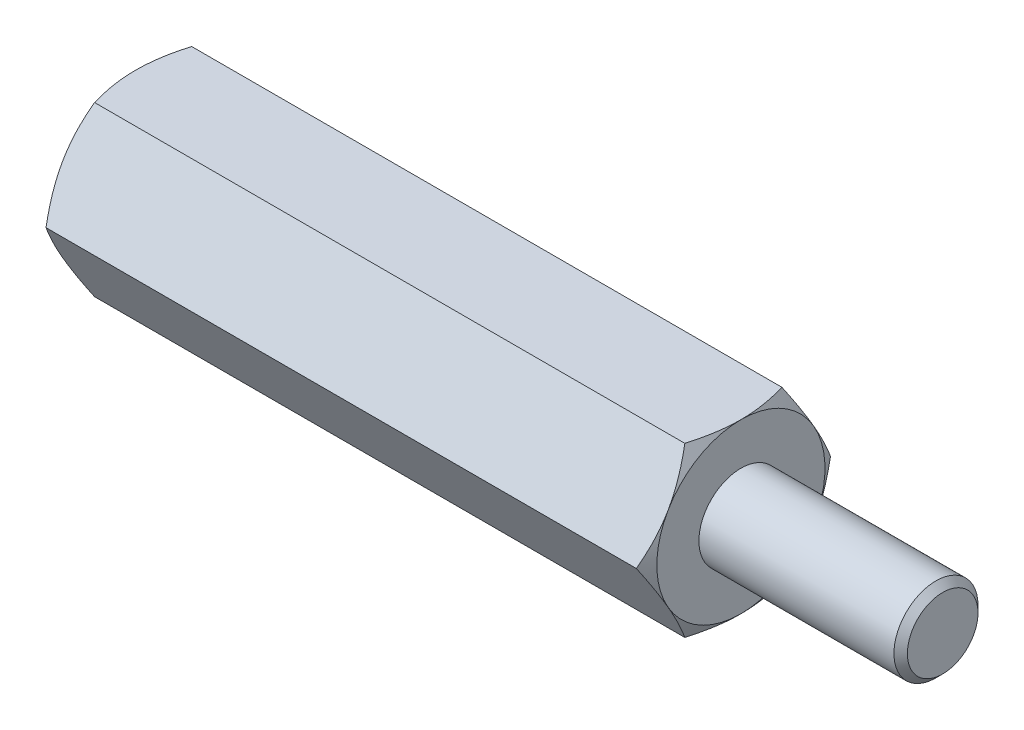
ISO-10303-21;
HEADER;
FILE_DESCRIPTION(('STEP AP214'),'2;1');
FILE_NAME('part.step','',(''),(''),'','','');
FILE_SCHEMA(('AUTOMOTIVE_DESIGN { 1 0 10303 214 1 1 1 1 }'));
ENDSEC;
DATA;
#1=APPLICATION_CONTEXT('core data for automotive mechanical design processes');
#2=APPLICATION_PROTOCOL_DEFINITION('international standard','automotive_design',2000,#1);
#3=PRODUCT_CONTEXT('',#1,'mechanical');
#4=PRODUCT('Part','Part','',(#3));
#5=PRODUCT_RELATED_PRODUCT_CATEGORY('part','',(#4));
#6=PRODUCT_DEFINITION_FORMATION('','',#4);
#7=PRODUCT_DEFINITION_CONTEXT('part definition',#1,'design');
#8=PRODUCT_DEFINITION('design','',#6,#7);
#9=PRODUCT_DEFINITION_SHAPE('','',#8);
#10=(LENGTH_UNIT() NAMED_UNIT(*) SI_UNIT(.MILLI.,.METRE.));
#11=(NAMED_UNIT(*) PLANE_ANGLE_UNIT() SI_UNIT($,.RADIAN.));
#12=(NAMED_UNIT(*) SI_UNIT($,.STERADIAN.) SOLID_ANGLE_UNIT());
#13=UNCERTAINTY_MEASURE_WITH_UNIT(LENGTH_MEASURE(1.E-05),#10,'distance_accuracy_value','');
#14=(GEOMETRIC_REPRESENTATION_CONTEXT(3) GLOBAL_UNCERTAINTY_ASSIGNED_CONTEXT((#13)) GLOBAL_UNIT_ASSIGNED_CONTEXT((#10,
#11,#12)) REPRESENTATION_CONTEXT('',''));
#15=CARTESIAN_POINT('',(0.,0.,0.));
#16=DIRECTION('',(0.,0.,1.));
#17=DIRECTION('',(1.,0.,0.));
#18=AXIS2_PLACEMENT_3D('',#15,#16,#17);
#19=CARTESIAN_POINT('',(9.,2.5,-1.44337567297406));
#20=DIRECTION('',(1.,0.,0.));
#21=DIRECTION('',(0.,0.,-1.));
#22=AXIS2_PLACEMENT_3D('',#19,#20,#21);
#23=PLANE('',#22);
#24=CARTESIAN_POINT('',(9.,0.,0.));
#25=DIRECTION('',(1.,0.,0.));
#26=DIRECTION('',(0.,0.,-1.));
#27=AXIS2_PLACEMENT_3D('',#24,#25,#26);
#28=CIRCLE('',#27,2.5);
#29=CARTESIAN_POINT('',(9.,-1.25,-2.1650635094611));
#30=VERTEX_POINT('',#29);
#31=CARTESIAN_POINT('',(9.,1.25,-2.1650635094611));
#32=VERTEX_POINT('',#31);
#33=EDGE_CURVE('E288',#30,#32,#28,.T.);
#34=ORIENTED_EDGE('',*,*,#33,.T.);
#35=CARTESIAN_POINT('',(9.,2.5,0.));
#36=VERTEX_POINT('',#35);
#37=EDGE_CURVE('E53',#32,#36,#28,.T.);
#38=ORIENTED_EDGE('',*,*,#37,.T.);
#39=CARTESIAN_POINT('',(9.,1.25,2.1650635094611));
#40=VERTEX_POINT('',#39);
#41=EDGE_CURVE('E295',#36,#40,#28,.T.);
#42=ORIENTED_EDGE('',*,*,#41,.T.);
#43=CARTESIAN_POINT('',(9.,-1.25,2.1650635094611));
#44=VERTEX_POINT('',#43);
#45=EDGE_CURVE('E301',#40,#44,#28,.T.);
#46=ORIENTED_EDGE('',*,*,#45,.T.);
#47=CARTESIAN_POINT('',(9.,0.,0.));
#48=DIRECTION('',(-1.,0.,0.));
#49=DIRECTION('',(0.,-1.,0.));
#50=AXIS2_PLACEMENT_3D('',#47,#48,#49);
#51=CIRCLE('',#50,2.5);
#52=CARTESIAN_POINT('',(9.,-2.5,0.));
#53=VERTEX_POINT('',#52);
#54=EDGE_CURVE('E193',#53,#44,#51,.T.);
#55=ORIENTED_EDGE('',*,*,#54,.F.);
#56=EDGE_CURVE('E61',#53,#30,#28,.T.);
#57=ORIENTED_EDGE('',*,*,#56,.T.);
#58=EDGE_LOOP('',(#34,#38,#42,#46,#55,#57));
#59=FACE_BOUND('',#58,.T.);
#60=CARTESIAN_POINT('',(9.,0.,0.));
#61=DIRECTION('',(1.,0.,0.));
#62=DIRECTION('',(0.,0.,-1.));
#63=AXIS2_PLACEMENT_3D('',#60,#61,#62);
#64=CIRCLE('',#63,1.25);
#65=CARTESIAN_POINT('',(9.,0.,-1.25));
#66=VERTEX_POINT('',#65);
#67=EDGE_CURVE('E351',#66,#66,#64,.T.);
#68=ORIENTED_EDGE('',*,*,#67,.F.);
#69=EDGE_LOOP('',(#68));
#70=FACE_BOUND('',#69,.T.);
#71=ADVANCED_FACE('F37',(#59,#70),#23,.T.);
#72=CARTESIAN_POINT('',(9.,0.,-2.88675134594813));
#73=DIRECTION('',(0.,-0.5,0.866025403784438));
#74=DIRECTION('',(0.,-0.866025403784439,-0.5));
#75=AXIS2_PLACEMENT_3D('',#72,#73,#74);
#76=PLANE('',#75);
#77=CARTESIAN_POINT('',(8.7766423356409,-0.000199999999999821,-2.88686681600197));
#78=CARTESIAN_POINT('',(8.81327837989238,0.109663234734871,-2.82343724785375));
#79=CARTESIAN_POINT('',(8.84659778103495,0.220474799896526,-2.75946016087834));
#80=CARTESIAN_POINT('',(8.90475771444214,0.44401683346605,-2.63039810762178));
#81=CARTESIAN_POINT('',(8.92957767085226,0.556751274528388,-2.5653108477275));
#82=CARTESIAN_POINT('',(8.96821434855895,0.780822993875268,-2.43594298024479));
#83=CARTESIAN_POINT('',(8.98228820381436,0.892125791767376,-2.37168227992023));
#84=CARTESIAN_POINT('',(8.99909084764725,1.11525522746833,-2.24285844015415));
#85=CARTESIAN_POINT('',(9.00183354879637,1.22708105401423,-2.17829576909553));
#86=CARTESIAN_POINT('',(8.99613423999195,1.43604197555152,-2.05765212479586));
#87=CARTESIAN_POINT('',(8.98909160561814,1.53320831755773,-2.0015531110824));
#88=CARTESIAN_POINT('',(8.96676858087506,1.726907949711,-1.88972057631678));
#89=CARTESIAN_POINT('',(8.95148056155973,1.82344056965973,-1.8339874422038));
#90=CARTESIAN_POINT('',(8.91326090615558,2.01753972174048,-1.7219242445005));
#91=CARTESIAN_POINT('',(8.89016722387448,2.11508168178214,-1.66560836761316));
#92=CARTESIAN_POINT('',(8.83775334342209,2.30871060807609,-1.55381665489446));
#93=CARTESIAN_POINT('',(8.80844546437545,2.40480005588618,-1.49833938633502));
#94=CARTESIAN_POINT('',(8.7766423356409,2.5002,-1.44326020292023));
#95=B_SPLINE_CURVE_WITH_KNOTS('',3,(#77,#78,#79,#80,#81,#82,#83,#84,#85,#86,#87,#88,#89,#90,#91,
#92,#93,#94),.UNSPECIFIED.,.F.,.F.,(4,2,2,2,2,2,2,2,4),(0.,0.396285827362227,0.79352433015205,
1.18093086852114,1.56786160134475,1.90479741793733,2.24204551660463,2.58677531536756,
2.93082800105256),.UNSPECIFIED.);
#96=CARTESIAN_POINT('',(8.7767090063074,0.,-2.88675134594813));
#97=VERTEX_POINT('',#96);
#98=EDGE_CURVE('E324',#97,#32,#95,.T.);
#99=ORIENTED_EDGE('',*,*,#98,.F.);
#100=DIRECTION('',(-1.,0.,0.));
#101=VECTOR('',#100,1.);
#102=CARTESIAN_POINT('',(9.,0.,-2.88675134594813));
#103=LINE('',#102,#101);
#104=CARTESIAN_POINT('',(-8.7767090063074,0.,-2.88675134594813));
#105=VERTEX_POINT('',#104);
#106=EDGE_CURVE('E264',#97,#105,#103,.T.);
#107=ORIENTED_EDGE('',*,*,#106,.T.);
#108=CARTESIAN_POINT('',(-8.7766423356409,2.5002,-1.44326020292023));
#109=CARTESIAN_POINT('',(-8.81327837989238,2.39033676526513,-1.50668977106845));
#110=CARTESIAN_POINT('',(-8.84659778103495,2.27952520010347,-1.57066685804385));
#111=CARTESIAN_POINT('',(-8.90475771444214,2.05598316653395,-1.69972891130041));
#112=CARTESIAN_POINT('',(-8.92957767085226,1.94324872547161,-1.7648161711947));
#113=CARTESIAN_POINT('',(-8.96821434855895,1.71917700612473,-1.8941840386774));
#114=CARTESIAN_POINT('',(-8.98228820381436,1.60787420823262,-1.95844473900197));
#115=CARTESIAN_POINT('',(-8.99909084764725,1.38474477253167,-2.08726857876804));
#116=CARTESIAN_POINT('',(-9.00183354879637,1.27291894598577,-2.15183124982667));
#117=CARTESIAN_POINT('',(-8.99613423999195,1.06395802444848,-2.27247489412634));
#118=CARTESIAN_POINT('',(-8.98909160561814,0.96679168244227,-2.32857390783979));
#119=CARTESIAN_POINT('',(-8.96676858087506,0.773092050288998,-2.44040644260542));
#120=CARTESIAN_POINT('',(-8.95148056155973,0.676559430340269,-2.49613957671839));
#121=CARTESIAN_POINT('',(-8.91326090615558,0.482460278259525,-2.60820277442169));
#122=CARTESIAN_POINT('',(-8.89016722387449,0.38491831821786,-2.66451865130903));
#123=CARTESIAN_POINT('',(-8.83775334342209,0.191289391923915,-2.77631036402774));
#124=CARTESIAN_POINT('',(-8.80844546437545,0.0951999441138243,-2.83178763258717));
#125=CARTESIAN_POINT('',(-8.7766423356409,-0.000199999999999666,-2.88686681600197));
#126=B_SPLINE_CURVE_WITH_KNOTS('',3,(#108,#109,#110,#111,#112,#113,#114,#115,#116,#117,#118,
#119,#120,#121,#122,#123,#124,#125),.UNSPECIFIED.,.F.,.F.,(4,2,2,2,2,2,2,2,4),(0.,
0.396285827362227,0.79352433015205,1.18093086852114,1.56786160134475,1.90479741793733,
2.24204551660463,2.58677531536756,2.93082800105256),.UNSPECIFIED.);
#127=CARTESIAN_POINT('',(-9.,1.25,-2.1650635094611));
#128=VERTEX_POINT('',#127);
#129=EDGE_CURVE('E318',#128,#105,#126,.T.);
#130=ORIENTED_EDGE('',*,*,#129,.F.);
#131=CARTESIAN_POINT('',(-8.7767090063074,2.5,-1.44337567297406));
#132=VERTEX_POINT('',#131);
#133=EDGE_CURVE('E321',#132,#128,#126,.T.);
#134=ORIENTED_EDGE('',*,*,#133,.F.);
#135=DIRECTION('',(-1.,0.,0.));
#136=VECTOR('',#135,1.);
#137=CARTESIAN_POINT('',(9.,2.5,-1.44337567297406));
#138=LINE('',#137,#136);
#139=CARTESIAN_POINT('',(8.77670900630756,2.5,-1.44337567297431));
#140=VERTEX_POINT('',#139);
#141=EDGE_CURVE('E279',#140,#132,#138,.T.);
#142=ORIENTED_EDGE('',*,*,#141,.F.);
#143=EDGE_CURVE('E229',#32,#140,#95,.T.);
#144=ORIENTED_EDGE('',*,*,#143,.F.);
#145=EDGE_LOOP('',(#99,#107,#130,#134,#142,#144));
#146=FACE_BOUND('',#145,.T.);
#147=ADVANCED_FACE('F148',(#146),#76,.F.);
#148=CARTESIAN_POINT('',(9.,2.5,-1.44337567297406));
#149=DIRECTION('',(0.,-1.,0.));
#150=DIRECTION('',(0.,0.,-1.));
#151=AXIS2_PLACEMENT_3D('',#148,#149,#150);
#152=PLANE('',#151);
#153=CARTESIAN_POINT('',(7.76803388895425,2.5,-3.90158441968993));
#154=CARTESIAN_POINT('',(7.82120772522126,2.5,-3.79217004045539));
#155=CARTESIAN_POINT('',(7.87387869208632,2.5,-3.68250707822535));
#156=CARTESIAN_POINT('',(7.97793249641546,2.5,-3.46255185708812));
#157=CARTESIAN_POINT('',(8.02931513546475,2.5,-3.35225950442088));
#158=CARTESIAN_POINT('',(8.13076309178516,2.5,-3.13035696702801));
#159=CARTESIAN_POINT('',(8.18081992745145,2.5,-3.0187428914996));
#160=CARTESIAN_POINT('',(8.27891712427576,2.5,-2.79463535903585));
#161=CARTESIAN_POINT('',(8.32695757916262,2.5,-2.68214194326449));
#162=CARTESIAN_POINT('',(8.42201845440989,2.5,-2.45240385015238));
#163=CARTESIAN_POINT('',(8.46895431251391,2.5,-2.33512399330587));
#164=CARTESIAN_POINT('',(8.55933269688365,2.5,-2.09920133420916));
#165=CARTESIAN_POINT('',(8.60277483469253,2.5,-1.98055838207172));
#166=CARTESIAN_POINT('',(8.68504351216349,2.5,-1.74193489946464));
#167=CARTESIAN_POINT('',(8.72387917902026,2.5,-1.6219575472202));
#168=CARTESIAN_POINT('',(8.79570507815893,2.5,-1.38028205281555));
#169=CARTESIAN_POINT('',(8.82869712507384,2.5,-1.25858445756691));
#170=CARTESIAN_POINT('',(8.88709594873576,2.5,-1.01406369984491));
#171=CARTESIAN_POINT('',(8.91254379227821,2.5,-0.89125052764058));
#172=CARTESIAN_POINT('',(8.95442751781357,2.5,-0.644071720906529));
#173=CARTESIAN_POINT('',(8.97086432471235,2.5,-0.519706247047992));
#174=CARTESIAN_POINT('',(8.9932006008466,2.5,-0.271679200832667));
#175=CARTESIAN_POINT('',(8.99923751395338,2.5,-0.148030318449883));
#176=CARTESIAN_POINT('',(9.00062561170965,2.5,0.0993395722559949));
#177=CARTESIAN_POINT('',(8.99597656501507,2.5,0.223060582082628));
#178=CARTESIAN_POINT('',(8.97940443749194,2.5,0.432351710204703));
#179=CARTESIAN_POINT('',(8.97010665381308,2.5,0.518143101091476));
#180=CARTESIAN_POINT('',(8.94693847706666,2.5,0.689112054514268));
#181=CARTESIAN_POINT('',(8.93306748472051,2.5,0.77428953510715));
#182=CARTESIAN_POINT('',(8.88532020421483,2.5,1.02876599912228));
#183=CARTESIAN_POINT('',(8.84531764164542,2.5,1.19691958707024));
#184=CARTESIAN_POINT('',(8.75226567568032,2.5,1.53362893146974));
#185=CARTESIAN_POINT('',(8.69893620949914,2.5,1.70210423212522));
#186=CARTESIAN_POINT('',(8.61237169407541,2.5,1.95247339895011));
#187=CARTESIAN_POINT('',(8.58242477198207,2.5,2.03553184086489));
#188=CARTESIAN_POINT('',(8.52068409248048,2.5,2.20095860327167));
#189=CARTESIAN_POINT('',(8.48889037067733,2.5,2.2833269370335));
#190=CARTESIAN_POINT('',(8.40401426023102,2.5,2.49723312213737));
#191=CARTESIAN_POINT('',(8.34971733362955,2.5,2.6282879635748));
#192=CARTESIAN_POINT('',(8.23812739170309,2.5,2.88912034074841));
#193=CARTESIAN_POINT('',(8.1808341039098,2.5,3.01889775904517));
#194=CARTESIAN_POINT('',(8.06393487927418,2.5,3.27745045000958));
#195=CARTESIAN_POINT('',(8.00432825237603,2.5,3.40622540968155));
#196=CARTESIAN_POINT('',(7.88332345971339,2.5,3.66293235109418));
#197=CARTESIAN_POINT('',(7.82192524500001,2.5,3.79086430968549));
#198=CARTESIAN_POINT('',(7.6354580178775,2.5,4.17399495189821));
#199=CARTESIAN_POINT('',(7.50828249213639,2.5,4.42816724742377));
#200=CARTESIAN_POINT('',(7.25034557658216,2.5,4.93461464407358));
#201=CARTESIAN_POINT('',(7.11958483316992,2.5,5.18689007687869));
#202=CARTESIAN_POINT('',(6.86871001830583,2.5,5.66512451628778));
#203=CARTESIAN_POINT('',(6.74882986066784,2.5,5.89120644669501));
#204=CARTESIAN_POINT('',(6.50759021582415,2.5,6.34259369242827));
#205=CARTESIAN_POINT('',(6.38623065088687,2.5,6.56789896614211));
#206=CARTESIAN_POINT('',(6.14278038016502,2.5,7.01722044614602));
#207=CARTESIAN_POINT('',(6.02069305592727,2.5,7.24123848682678));
#208=CARTESIAN_POINT('',(5.77566624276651,2.5,7.68878772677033));
#209=CARTESIAN_POINT('',(5.65272681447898,2.5,7.91231895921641));
#210=CARTESIAN_POINT('',(5.52947566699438,2.5,8.13567697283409));
#211=B_SPLINE_CURVE_WITH_KNOTS('',3,(#153,#154,#155,#156,#157,#158,#159,#160,#161,#162,#163,
#164,#165,#166,#167,#168,#169,#170,#171,#172,#173,#174,#175,#176,#177,#178,#179,#180,#181,#182,
#183,#184,#185,#186,#187,#188,#189,#190,#191,#192,#193,#194,#195,#196,#197,#198,#199,#200,#201,
#202,#203,#204,#205,#206,#207,#208,#209,#210),.UNSPECIFIED.,.F.,.F.,(4,2,2,2,2,2,2,2,2,2,2,2,2,
2,2,2,2,2,2,2,2,2,2,2,2,2,2,2,4),(0.,0.364957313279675,0.729970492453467,1.09692930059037,
1.46387103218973,1.84279746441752,2.22176597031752,2.59997058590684,2.97805755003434,
3.35404692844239,3.72999770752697,4.10094071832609,4.47189175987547,4.73064905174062,
4.98944026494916,5.5072907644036,6.03710483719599,6.30196454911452,6.56681915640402,
6.99233818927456,7.41789598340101,7.84358170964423,8.26927907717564,9.12186602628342,
9.9743002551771,10.7419897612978,11.5097197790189,12.2750964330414,13.0404191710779),.UNSPECIFIED.);
#212=EDGE_CURVE('E227',#140,#36,#211,.T.);
#213=ORIENTED_EDGE('',*,*,#212,.F.);
#214=ORIENTED_EDGE('',*,*,#141,.T.);
#215=CARTESIAN_POINT('',(-7.76803388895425,2.5,-3.90158441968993));
#216=CARTESIAN_POINT('',(-7.82120772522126,2.5,-3.79217004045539));
#217=CARTESIAN_POINT('',(-7.87387869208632,2.5,-3.68250707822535));
#218=CARTESIAN_POINT('',(-7.97793249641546,2.5,-3.46255185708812));
#219=CARTESIAN_POINT('',(-8.02931513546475,2.5,-3.35225950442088));
#220=CARTESIAN_POINT('',(-8.13076309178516,2.5,-3.13035696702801));
#221=CARTESIAN_POINT('',(-8.18081992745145,2.5,-3.0187428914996));
#222=CARTESIAN_POINT('',(-8.27891712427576,2.5,-2.79463535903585));
#223=CARTESIAN_POINT('',(-8.32695757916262,2.5,-2.68214194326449));
#224=CARTESIAN_POINT('',(-8.42201845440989,2.5,-2.45240385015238));
#225=CARTESIAN_POINT('',(-8.46895431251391,2.5,-2.33512399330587));
#226=CARTESIAN_POINT('',(-8.55933269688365,2.5,-2.09920133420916));
#227=CARTESIAN_POINT('',(-8.60277483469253,2.5,-1.98055838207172));
#228=CARTESIAN_POINT('',(-8.68504351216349,2.5,-1.74193489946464));
#229=CARTESIAN_POINT('',(-8.72387917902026,2.5,-1.6219575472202));
#230=CARTESIAN_POINT('',(-8.79570507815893,2.5,-1.38028205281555));
#231=CARTESIAN_POINT('',(-8.82869712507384,2.5,-1.25858445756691));
#232=CARTESIAN_POINT('',(-8.88709594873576,2.5,-1.01406369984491));
#233=CARTESIAN_POINT('',(-8.91254379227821,2.5,-0.89125052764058));
#234=CARTESIAN_POINT('',(-8.95442751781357,2.5,-0.644071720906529));
#235=CARTESIAN_POINT('',(-8.97086432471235,2.5,-0.519706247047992));
#236=CARTESIAN_POINT('',(-8.9932006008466,2.5,-0.271679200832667));
#237=CARTESIAN_POINT('',(-8.99923751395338,2.5,-0.148030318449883));
#238=CARTESIAN_POINT('',(-9.00062561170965,2.5,0.0993395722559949));
#239=CARTESIAN_POINT('',(-8.99597656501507,2.5,0.223060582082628));
#240=CARTESIAN_POINT('',(-8.97940443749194,2.5,0.432351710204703));
#241=CARTESIAN_POINT('',(-8.97010665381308,2.5,0.518143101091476));
#242=CARTESIAN_POINT('',(-8.94693847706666,2.5,0.689112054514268));
#243=CARTESIAN_POINT('',(-8.93306748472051,2.5,0.77428953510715));
#244=CARTESIAN_POINT('',(-8.88532020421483,2.5,1.02876599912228));
#245=CARTESIAN_POINT('',(-8.84531764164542,2.5,1.19691958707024));
#246=CARTESIAN_POINT('',(-8.75226567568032,2.5,1.53362893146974));
#247=CARTESIAN_POINT('',(-8.69893620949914,2.5,1.70210423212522));
#248=CARTESIAN_POINT('',(-8.61237169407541,2.5,1.95247339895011));
#249=CARTESIAN_POINT('',(-8.58242477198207,2.5,2.03553184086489));
#250=CARTESIAN_POINT('',(-8.52068409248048,2.5,2.20095860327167));
#251=CARTESIAN_POINT('',(-8.48889037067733,2.5,2.2833269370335));
#252=CARTESIAN_POINT('',(-8.40401426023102,2.5,2.49723312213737));
#253=CARTESIAN_POINT('',(-8.34971733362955,2.5,2.6282879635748));
#254=CARTESIAN_POINT('',(-8.23812739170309,2.5,2.88912034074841));
#255=CARTESIAN_POINT('',(-8.1808341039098,2.5,3.01889775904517));
#256=CARTESIAN_POINT('',(-8.06393487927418,2.5,3.27745045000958));
#257=CARTESIAN_POINT('',(-8.00432825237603,2.5,3.40622540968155));
#258=CARTESIAN_POINT('',(-7.88332345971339,2.5,3.66293235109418));
#259=CARTESIAN_POINT('',(-7.82192524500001,2.5,3.79086430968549));
#260=CARTESIAN_POINT('',(-7.6354580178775,2.5,4.17399495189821));
#261=CARTESIAN_POINT('',(-7.50828249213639,2.5,4.42816724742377));
#262=CARTESIAN_POINT('',(-7.25034557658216,2.5,4.93461464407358));
#263=CARTESIAN_POINT('',(-7.11958483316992,2.5,5.18689007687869));
#264=CARTESIAN_POINT('',(-6.86871001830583,2.5,5.66512451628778));
#265=CARTESIAN_POINT('',(-6.74882986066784,2.5,5.89120644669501));
#266=CARTESIAN_POINT('',(-6.50759021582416,2.5,6.34259369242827));
#267=CARTESIAN_POINT('',(-6.38623065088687,2.5,6.56789896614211));
#268=CARTESIAN_POINT('',(-6.14278038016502,2.5,7.01722044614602));
#269=CARTESIAN_POINT('',(-6.02069305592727,2.5,7.24123848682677));
#270=CARTESIAN_POINT('',(-5.77566624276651,2.5,7.68878772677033));
#271=CARTESIAN_POINT('',(-5.65272681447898,2.5,7.9123189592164));
#272=CARTESIAN_POINT('',(-5.52947566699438,2.5,8.13567697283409));
#273=B_SPLINE_CURVE_WITH_KNOTS('',3,(#215,#216,#217,#218,#219,#220,#221,#222,#223,#224,#225,
#226,#227,#228,#229,#230,#231,#232,#233,#234,#235,#236,#237,#238,#239,#240,#241,#242,#243,#244,
#245,#246,#247,#248,#249,#250,#251,#252,#253,#254,#255,#256,#257,#258,#259,#260,#261,#262,#263,
#264,#265,#266,#267,#268,#269,#270,#271,#272),.UNSPECIFIED.,.F.,.F.,(4,2,2,2,2,2,2,2,2,2,2,2,2,
2,2,2,2,2,2,2,2,2,2,2,2,2,2,2,4),(0.,0.364957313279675,0.729970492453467,1.09692930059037,
1.46387103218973,1.84279746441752,2.22176597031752,2.59997058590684,2.97805755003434,
3.35404692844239,3.72999770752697,4.10094071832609,4.47189175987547,4.73064905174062,
4.98944026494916,5.5072907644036,6.03710483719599,6.30196454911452,6.56681915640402,
6.99233818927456,7.41789598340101,7.84358170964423,8.26927907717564,9.12186602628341,
9.97430025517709,10.7419897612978,11.5097197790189,12.2750964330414,13.0404191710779),.UNSPECIFIED.);
#274=CARTESIAN_POINT('',(-9.,2.5,0.));
#275=VERTEX_POINT('',#274);
#276=EDGE_CURVE('E241',#275,#132,#273,.F.);
#277=ORIENTED_EDGE('',*,*,#276,.F.);
#278=CARTESIAN_POINT('',(-8.7767090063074,2.5,1.44337567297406));
#279=VERTEX_POINT('',#278);
#280=EDGE_CURVE('E249',#279,#275,#273,.F.);
#281=ORIENTED_EDGE('',*,*,#280,.F.);
#282=DIRECTION('',(-1.,0.,0.));
#283=VECTOR('',#282,1.);
#284=CARTESIAN_POINT('',(9.,2.5,1.44337567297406));
#285=LINE('',#284,#283);
#286=CARTESIAN_POINT('',(8.7767090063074,2.5,1.44337567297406));
#287=VERTEX_POINT('',#286);
#288=EDGE_CURVE('E276',#287,#279,#285,.T.);
#289=ORIENTED_EDGE('',*,*,#288,.F.);
#290=EDGE_CURVE('E221',#36,#287,#211,.T.);
#291=ORIENTED_EDGE('',*,*,#290,.F.);
#292=EDGE_LOOP('',(#213,#214,#277,#281,#289,#291));
#293=FACE_BOUND('',#292,.T.);
#294=ADVANCED_FACE('F153',(#293),#152,.F.);
#295=CARTESIAN_POINT('',(9.,2.5,1.44337567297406));
#296=DIRECTION('',(0.,-0.5,-0.866025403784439));
#297=DIRECTION('',(0.,0.866025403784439,-0.5));
#298=AXIS2_PLACEMENT_3D('',#295,#296,#297);
#299=PLANE('',#298);
#300=CARTESIAN_POINT('',(8.7766423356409,2.5002,1.44326020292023));
#301=CARTESIAN_POINT('',(8.81327837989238,2.39033676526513,1.50668977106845));
#302=CARTESIAN_POINT('',(8.84659778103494,2.27952520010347,1.57066685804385));
#303=CARTESIAN_POINT('',(8.90475771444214,2.05598316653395,1.69972891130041));
#304=CARTESIAN_POINT('',(8.92957767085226,1.94324872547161,1.7648161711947));
#305=CARTESIAN_POINT('',(8.96821434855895,1.71917700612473,1.8941840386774));
#306=CARTESIAN_POINT('',(8.98228820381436,1.60787420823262,1.95844473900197));
#307=CARTESIAN_POINT('',(8.99909084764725,1.38474477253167,2.08726857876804));
#308=CARTESIAN_POINT('',(9.00183354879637,1.27291894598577,2.15183124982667));
#309=CARTESIAN_POINT('',(8.99613423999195,1.06395802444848,2.27247489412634));
#310=CARTESIAN_POINT('',(8.98909160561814,0.96679168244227,2.32857390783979));
#311=CARTESIAN_POINT('',(8.96676858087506,0.773092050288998,2.44040644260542));
#312=CARTESIAN_POINT('',(8.95148056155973,0.676559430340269,2.49613957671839));
#313=CARTESIAN_POINT('',(8.91326090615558,0.482460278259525,2.60820277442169));
#314=CARTESIAN_POINT('',(8.89016722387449,0.384918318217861,2.66451865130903));
#315=CARTESIAN_POINT('',(8.83775334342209,0.191289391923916,2.77631036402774));
#316=CARTESIAN_POINT('',(8.80844546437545,0.0951999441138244,2.83178763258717));
#317=CARTESIAN_POINT('',(8.7766423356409,-0.00019999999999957,2.88686681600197));
#318=B_SPLINE_CURVE_WITH_KNOTS('',3,(#300,#301,#302,#303,#304,#305,#306,#307,#308,#309,#310,
#311,#312,#313,#314,#315,#316,#317),.UNSPECIFIED.,.F.,.F.,(4,2,2,2,2,2,2,2,4),(0.,
0.396285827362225,0.79352433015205,1.18093086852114,1.56786160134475,1.90479741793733,
2.24204551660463,2.58677531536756,2.93082800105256),.UNSPECIFIED.);
#319=EDGE_CURVE('E228',#287,#40,#318,.T.);
#320=ORIENTED_EDGE('',*,*,#319,.F.);
#321=ORIENTED_EDGE('',*,*,#288,.T.);
#322=CARTESIAN_POINT('',(-8.7766423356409,-0.000199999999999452,2.88686681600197));
#323=CARTESIAN_POINT('',(-8.81327837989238,0.109663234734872,2.82343724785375));
#324=CARTESIAN_POINT('',(-8.84659778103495,0.220474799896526,2.75946016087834));
#325=CARTESIAN_POINT('',(-8.90475771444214,0.44401683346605,2.63039810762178));
#326=CARTESIAN_POINT('',(-8.92957767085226,0.556751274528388,2.5653108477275));
#327=CARTESIAN_POINT('',(-8.96821434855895,0.780822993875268,2.43594298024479));
#328=CARTESIAN_POINT('',(-8.98228820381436,0.892125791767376,2.37168227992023));
#329=CARTESIAN_POINT('',(-8.99909084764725,1.11525522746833,2.24285844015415));
#330=CARTESIAN_POINT('',(-9.00183354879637,1.22708105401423,2.17829576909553));
#331=CARTESIAN_POINT('',(-8.99613423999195,1.43604197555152,2.05765212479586));
#332=CARTESIAN_POINT('',(-8.98909160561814,1.53320831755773,2.0015531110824));
#333=CARTESIAN_POINT('',(-8.96676858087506,1.726907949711,1.88972057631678));
#334=CARTESIAN_POINT('',(-8.95148056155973,1.82344056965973,1.8339874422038));
#335=CARTESIAN_POINT('',(-8.91326090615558,2.01753972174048,1.7219242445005));
#336=CARTESIAN_POINT('',(-8.89016722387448,2.11508168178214,1.66560836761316));
#337=CARTESIAN_POINT('',(-8.83775334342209,2.30871060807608,1.55381665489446));
#338=CARTESIAN_POINT('',(-8.80844546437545,2.40480005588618,1.49833938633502));
#339=CARTESIAN_POINT('',(-8.7766423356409,2.5002,1.44326020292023));
#340=B_SPLINE_CURVE_WITH_KNOTS('',3,(#322,#323,#324,#325,#326,#327,#328,#329,#330,#331,#332,
#333,#334,#335,#336,#337,#338,#339),.UNSPECIFIED.,.F.,.F.,(4,2,2,2,2,2,2,2,4),(0.,
0.396285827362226,0.793524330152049,1.18093086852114,1.56786160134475,1.90479741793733,
2.24204551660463,2.58677531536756,2.93082800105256),.UNSPECIFIED.);
#341=CARTESIAN_POINT('',(-9.,1.25,2.1650635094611));
#342=VERTEX_POINT('',#341);
#343=EDGE_CURVE('E255',#342,#279,#340,.T.);
#344=ORIENTED_EDGE('',*,*,#343,.F.);
#345=CARTESIAN_POINT('',(-8.7767090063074,0.,2.88675134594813));
#346=VERTEX_POINT('',#345);
#347=EDGE_CURVE('E262',#346,#342,#340,.T.);
#348=ORIENTED_EDGE('',*,*,#347,.F.);
#349=DIRECTION('',(-1.,0.,0.));
#350=VECTOR('',#349,1.);
#351=CARTESIAN_POINT('',(9.,0.,2.88675134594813));
#352=LINE('',#351,#350);
#353=CARTESIAN_POINT('',(8.7767090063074,0.,2.88675134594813));
#354=VERTEX_POINT('',#353);
#355=EDGE_CURVE('E273',#354,#346,#352,.T.);
#356=ORIENTED_EDGE('',*,*,#355,.F.);
#357=EDGE_CURVE('E215',#40,#354,#318,.T.);
#358=ORIENTED_EDGE('',*,*,#357,.F.);
#359=EDGE_LOOP('',(#320,#321,#344,#348,#356,#358));
#360=FACE_BOUND('',#359,.T.);
#361=ADVANCED_FACE('F235',(#360),#299,.F.);
#362=CARTESIAN_POINT('',(9.,0.,2.88675134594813));
#363=DIRECTION('',(0.,0.5,-0.866025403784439));
#364=DIRECTION('',(0.,0.866025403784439,0.5));
#365=AXIS2_PLACEMENT_3D('',#362,#363,#364);
#366=PLANE('',#365);
#367=CARTESIAN_POINT('',(8.7766423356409,0.000200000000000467,2.88686681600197));
#368=CARTESIAN_POINT('',(8.81327837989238,-0.109663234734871,2.82343724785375));
#369=CARTESIAN_POINT('',(8.84659778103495,-0.220474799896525,2.75946016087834));
#370=CARTESIAN_POINT('',(8.90475771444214,-0.444016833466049,2.63039810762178));
#371=CARTESIAN_POINT('',(8.92957767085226,-0.556751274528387,2.5653108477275));
#372=CARTESIAN_POINT('',(8.96821434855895,-0.780822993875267,2.43594298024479));
#373=CARTESIAN_POINT('',(8.98228820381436,-0.892125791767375,2.37168227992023));
#374=CARTESIAN_POINT('',(8.99909084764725,-1.11525522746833,2.24285844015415));
#375=CARTESIAN_POINT('',(9.00183354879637,-1.22708105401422,2.17829576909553));
#376=CARTESIAN_POINT('',(8.99613423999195,-1.43604197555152,2.05765212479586));
#377=CARTESIAN_POINT('',(8.98909160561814,-1.53320831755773,2.0015531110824));
#378=CARTESIAN_POINT('',(8.96676858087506,-1.726907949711,1.88972057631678));
#379=CARTESIAN_POINT('',(8.95148056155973,-1.82344056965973,1.8339874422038));
#380=CARTESIAN_POINT('',(8.91326090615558,-2.01753972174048,1.7219242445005));
#381=CARTESIAN_POINT('',(8.89016722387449,-2.11508168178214,1.66560836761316));
#382=CARTESIAN_POINT('',(8.83775334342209,-2.30871060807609,1.55381665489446));
#383=CARTESIAN_POINT('',(8.80844546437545,-2.40480005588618,1.49833938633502));
#384=CARTESIAN_POINT('',(8.7766423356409,-2.5002,1.44326020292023));
#385=B_SPLINE_CURVE_WITH_KNOTS('',3,(#367,#368,#369,#370,#371,#372,#373,#374,#375,#376,#377,
#378,#379,#380,#381,#382,#383,#384),.UNSPECIFIED.,.F.,.F.,(4,2,2,2,2,2,2,2,4),(0.,
0.396285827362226,0.793524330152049,1.18093086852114,1.56786160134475,1.90479741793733,
2.24204551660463,2.58677531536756,2.93082800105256),.UNSPECIFIED.);
#386=EDGE_CURVE('E316',#354,#44,#385,.T.);
#387=ORIENTED_EDGE('',*,*,#386,.F.);
#388=ORIENTED_EDGE('',*,*,#355,.T.);
#389=CARTESIAN_POINT('',(-8.7766423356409,-2.5002,1.44326020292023));
#390=CARTESIAN_POINT('',(-8.81327837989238,-2.39033676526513,1.50668977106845));
#391=CARTESIAN_POINT('',(-8.84659778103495,-2.27952520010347,1.57066685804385));
#392=CARTESIAN_POINT('',(-8.90475771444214,-2.05598316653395,1.69972891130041));
#393=CARTESIAN_POINT('',(-8.92957767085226,-1.94324872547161,1.7648161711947));
#394=CARTESIAN_POINT('',(-8.96821434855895,-1.71917700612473,1.8941840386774));
#395=CARTESIAN_POINT('',(-8.98228820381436,-1.60787420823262,1.95844473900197));
#396=CARTESIAN_POINT('',(-8.99909084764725,-1.38474477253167,2.08726857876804));
#397=CARTESIAN_POINT('',(-9.00183354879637,-1.27291894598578,2.15183124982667));
#398=CARTESIAN_POINT('',(-8.99613423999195,-1.06395802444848,2.27247489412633));
#399=CARTESIAN_POINT('',(-8.98909160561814,-0.966791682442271,2.32857390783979));
#400=CARTESIAN_POINT('',(-8.96676858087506,-0.773092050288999,2.44040644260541));
#401=CARTESIAN_POINT('',(-8.95148056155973,-0.676559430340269,2.49613957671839));
#402=CARTESIAN_POINT('',(-8.91326090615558,-0.482460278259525,2.60820277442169));
#403=CARTESIAN_POINT('',(-8.89016722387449,-0.38491831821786,2.66451865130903));
#404=CARTESIAN_POINT('',(-8.83775334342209,-0.191289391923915,2.77631036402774));
#405=CARTESIAN_POINT('',(-8.80844546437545,-0.0951999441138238,2.83178763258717));
#406=CARTESIAN_POINT('',(-8.7766423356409,0.000200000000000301,2.88686681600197));
#407=B_SPLINE_CURVE_WITH_KNOTS('',3,(#389,#390,#391,#392,#393,#394,#395,#396,#397,#398,#399,
#400,#401,#402,#403,#404,#405,#406),.UNSPECIFIED.,.F.,.F.,(4,2,2,2,2,2,2,2,4),(0.,
0.396285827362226,0.793524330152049,1.18093086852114,1.56786160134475,1.90479741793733,
2.24204551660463,2.58677531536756,2.93082800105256),.UNSPECIFIED.);
#408=CARTESIAN_POINT('',(-9.,-1.25,2.1650635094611));
#409=VERTEX_POINT('',#408);
#410=EDGE_CURVE('E263',#409,#346,#407,.T.);
#411=ORIENTED_EDGE('',*,*,#410,.F.);
#412=CARTESIAN_POINT('',(-8.7767090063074,-2.5,1.44337567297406));
#413=VERTEX_POINT('',#412);
#414=EDGE_CURVE('E250',#413,#409,#407,.T.);
#415=ORIENTED_EDGE('',*,*,#414,.F.);
#416=DIRECTION('',(-1.,0.,0.));
#417=VECTOR('',#416,1.);
#418=CARTESIAN_POINT('',(9.,-2.5,1.44337567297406));
#419=LINE('',#418,#417);
#420=CARTESIAN_POINT('',(8.7767090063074,-2.5,1.44337567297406));
#421=VERTEX_POINT('',#420);
#422=EDGE_CURVE('E270',#421,#413,#419,.T.);
#423=ORIENTED_EDGE('',*,*,#422,.F.);
#424=EDGE_CURVE('E210',#44,#421,#385,.T.);
#425=ORIENTED_EDGE('',*,*,#424,.F.);
#426=EDGE_LOOP('',(#387,#388,#411,#415,#423,#425));
#427=FACE_BOUND('',#426,.T.);
#428=ADVANCED_FACE('F397',(#427),#366,.F.);
#429=CARTESIAN_POINT('',(9.,-2.5,1.44337567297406));
#430=DIRECTION('',(0.,1.,0.));
#431=DIRECTION('',(0.,0.,1.));
#432=AXIS2_PLACEMENT_3D('',#429,#430,#431);
#433=PLANE('',#432);
#434=CARTESIAN_POINT('',(7.76803388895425,-2.5,-3.90158441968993));
#435=CARTESIAN_POINT('',(7.82120772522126,-2.5,-3.79217004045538));
#436=CARTESIAN_POINT('',(7.87387869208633,-2.5,-3.68250707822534));
#437=CARTESIAN_POINT('',(7.97793249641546,-2.5,-3.46255185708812));
#438=CARTESIAN_POINT('',(8.02931513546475,-2.5,-3.35225950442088));
#439=CARTESIAN_POINT('',(8.13076309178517,-2.5,-3.130356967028));
#440=CARTESIAN_POINT('',(8.18081992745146,-2.5,-3.01874289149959));
#441=CARTESIAN_POINT('',(8.27891712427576,-2.5,-2.79463535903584));
#442=CARTESIAN_POINT('',(8.32695757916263,-2.5,-2.68214194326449));
#443=CARTESIAN_POINT('',(8.42201845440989,-2.5,-2.45240385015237));
#444=CARTESIAN_POINT('',(8.46895431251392,-2.5,-2.33512399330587));
#445=CARTESIAN_POINT('',(8.55933269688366,-2.5,-2.09920133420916));
#446=CARTESIAN_POINT('',(8.60277483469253,-2.5,-1.98055838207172));
#447=CARTESIAN_POINT('',(8.68504351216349,-2.5,-1.74193489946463));
#448=CARTESIAN_POINT('',(8.72387917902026,-2.5,-1.6219575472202));
#449=CARTESIAN_POINT('',(8.79570507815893,-2.5,-1.38028205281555));
#450=CARTESIAN_POINT('',(8.82869712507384,-2.5,-1.25858445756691));
#451=CARTESIAN_POINT('',(8.88709594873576,-2.5,-1.01406369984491));
#452=CARTESIAN_POINT('',(8.91254379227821,-2.5,-0.891250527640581));
#453=CARTESIAN_POINT('',(8.95442751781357,-2.5,-0.644071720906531));
#454=CARTESIAN_POINT('',(8.97086432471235,-2.5,-0.519706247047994));
#455=CARTESIAN_POINT('',(8.9932006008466,-2.5,-0.27167920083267));
#456=CARTESIAN_POINT('',(8.99923751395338,-2.5,-0.148030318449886));
#457=CARTESIAN_POINT('',(9.00062561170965,-2.5,0.0993395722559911));
#458=CARTESIAN_POINT('',(8.99597656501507,-2.5,0.223060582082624));
#459=CARTESIAN_POINT('',(8.97940443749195,-2.5,0.432351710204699));
#460=CARTESIAN_POINT('',(8.97010665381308,-2.5,0.518143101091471));
#461=CARTESIAN_POINT('',(8.94693847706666,-2.5,0.689112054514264));
#462=CARTESIAN_POINT('',(8.93306748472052,-2.5,0.774289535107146));
#463=CARTESIAN_POINT('',(8.88532020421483,-2.5,1.02876599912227));
#464=CARTESIAN_POINT('',(8.84531764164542,-2.5,1.19691958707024));
#465=CARTESIAN_POINT('',(8.75226567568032,-2.5,1.53362893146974));
#466=CARTESIAN_POINT('',(8.69893620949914,-2.5,1.70210423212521));
#467=CARTESIAN_POINT('',(8.61237169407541,-2.5,1.95247339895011));
#468=CARTESIAN_POINT('',(8.58242477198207,-2.5,2.03553184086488));
#469=CARTESIAN_POINT('',(8.52068409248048,-2.5,2.20095860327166));
#470=CARTESIAN_POINT('',(8.48889037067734,-2.5,2.28332693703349));
#471=CARTESIAN_POINT('',(8.40401426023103,-2.5,2.49723312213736));
#472=CARTESIAN_POINT('',(8.34971733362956,-2.5,2.6282879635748));
#473=CARTESIAN_POINT('',(8.2381273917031,-2.5,2.8891203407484));
#474=CARTESIAN_POINT('',(8.1808341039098,-2.5,3.01889775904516));
#475=CARTESIAN_POINT('',(8.06393487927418,-2.5,3.27745045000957));
#476=CARTESIAN_POINT('',(8.00432825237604,-2.5,3.40622540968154));
#477=CARTESIAN_POINT('',(7.8833234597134,-2.5,3.66293235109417));
#478=CARTESIAN_POINT('',(7.82192524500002,-2.5,3.79086430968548));
#479=CARTESIAN_POINT('',(7.6354580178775,-2.5,4.1739949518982));
#480=CARTESIAN_POINT('',(7.50828249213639,-2.5,4.42816724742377));
#481=CARTESIAN_POINT('',(7.25034557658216,-2.5,4.93461464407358));
#482=CARTESIAN_POINT('',(7.11958483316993,-2.5,5.18689007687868));
#483=CARTESIAN_POINT('',(6.86871001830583,-2.5,5.66512451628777));
#484=CARTESIAN_POINT('',(6.74882986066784,-2.5,5.891206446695));
#485=CARTESIAN_POINT('',(6.50759021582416,-2.5,6.34259369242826));
#486=CARTESIAN_POINT('',(6.38623065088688,-2.5,6.5678989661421));
#487=CARTESIAN_POINT('',(6.14278038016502,-2.5,7.01722044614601));
#488=CARTESIAN_POINT('',(6.02069305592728,-2.5,7.24123848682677));
#489=CARTESIAN_POINT('',(5.77566624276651,-2.5,7.68878772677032));
#490=CARTESIAN_POINT('',(5.65272681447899,-2.5,7.9123189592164));
#491=CARTESIAN_POINT('',(5.52947566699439,-2.5,8.13567697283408));
#492=B_SPLINE_CURVE_WITH_KNOTS('',3,(#434,#435,#436,#437,#438,#439,#440,#441,#442,#443,#444,
#445,#446,#447,#448,#449,#450,#451,#452,#453,#454,#455,#456,#457,#458,#459,#460,#461,#462,#463,
#464,#465,#466,#467,#468,#469,#470,#471,#472,#473,#474,#475,#476,#477,#478,#479,#480,#481,#482,
#483,#484,#485,#486,#487,#488,#489,#490,#491),.UNSPECIFIED.,.F.,.F.,(4,2,2,2,2,2,2,2,2,2,2,2,2,
2,2,2,2,2,2,2,2,2,2,2,2,2,2,2,4),(0.,0.364957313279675,0.729970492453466,1.09692930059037,
1.46387103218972,1.84279746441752,2.22176597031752,2.59997058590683,2.97805755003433,
3.35404692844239,3.72999770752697,4.10094071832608,4.47189175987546,4.73064905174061,
4.98944026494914,5.50729076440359,6.03710483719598,6.30196454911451,6.56681915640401,
6.99233818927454,7.417895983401,7.84358170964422,8.26927907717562,9.1218660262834,
9.97430025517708,10.7419897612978,11.5097197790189,12.2750964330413,13.0404191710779),.UNSPECIFIED.);
#493=EDGE_CURVE('E317',#421,#53,#492,.F.);
#494=ORIENTED_EDGE('',*,*,#493,.F.);
#495=ORIENTED_EDGE('',*,*,#422,.T.);
#496=CARTESIAN_POINT('',(-7.76803388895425,-2.5,-3.90158441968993));
#497=CARTESIAN_POINT('',(-7.82120772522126,-2.5,-3.79217004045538));
#498=CARTESIAN_POINT('',(-7.87387869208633,-2.5,-3.68250707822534));
#499=CARTESIAN_POINT('',(-7.97793249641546,-2.5,-3.46255185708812));
#500=CARTESIAN_POINT('',(-8.02931513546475,-2.5,-3.35225950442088));
#501=CARTESIAN_POINT('',(-8.13076309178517,-2.5,-3.130356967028));
#502=CARTESIAN_POINT('',(-8.18081992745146,-2.5,-3.01874289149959));
#503=CARTESIAN_POINT('',(-8.27891712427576,-2.5,-2.79463535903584));
#504=CARTESIAN_POINT('',(-8.32695757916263,-2.5,-2.68214194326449));
#505=CARTESIAN_POINT('',(-8.42201845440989,-2.5,-2.45240385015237));
#506=CARTESIAN_POINT('',(-8.46895431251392,-2.5,-2.33512399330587));
#507=CARTESIAN_POINT('',(-8.55933269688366,-2.5,-2.09920133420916));
#508=CARTESIAN_POINT('',(-8.60277483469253,-2.5,-1.98055838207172));
#509=CARTESIAN_POINT('',(-8.68504351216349,-2.5,-1.74193489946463));
#510=CARTESIAN_POINT('',(-8.72387917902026,-2.5,-1.6219575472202));
#511=CARTESIAN_POINT('',(-8.79570507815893,-2.5,-1.38028205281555));
#512=CARTESIAN_POINT('',(-8.82869712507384,-2.5,-1.25858445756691));
#513=CARTESIAN_POINT('',(-8.88709594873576,-2.5,-1.01406369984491));
#514=CARTESIAN_POINT('',(-8.91254379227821,-2.5,-0.891250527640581));
#515=CARTESIAN_POINT('',(-8.95442751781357,-2.5,-0.644071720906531));
#516=CARTESIAN_POINT('',(-8.97086432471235,-2.5,-0.519706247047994));
#517=CARTESIAN_POINT('',(-8.9932006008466,-2.5,-0.27167920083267));
#518=CARTESIAN_POINT('',(-8.99923751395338,-2.5,-0.148030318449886));
#519=CARTESIAN_POINT('',(-9.00062561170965,-2.5,0.0993395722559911));
#520=CARTESIAN_POINT('',(-8.99597656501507,-2.5,0.223060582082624));
#521=CARTESIAN_POINT('',(-8.97940443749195,-2.5,0.432351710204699));
#522=CARTESIAN_POINT('',(-8.97010665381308,-2.5,0.518143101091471));
#523=CARTESIAN_POINT('',(-8.94693847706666,-2.5,0.689112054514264));
#524=CARTESIAN_POINT('',(-8.93306748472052,-2.5,0.774289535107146));
#525=CARTESIAN_POINT('',(-8.88532020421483,-2.5,1.02876599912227));
#526=CARTESIAN_POINT('',(-8.84531764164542,-2.5,1.19691958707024));
#527=CARTESIAN_POINT('',(-8.75226567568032,-2.5,1.53362893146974));
#528=CARTESIAN_POINT('',(-8.69893620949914,-2.5,1.70210423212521));
#529=CARTESIAN_POINT('',(-8.61237169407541,-2.5,1.95247339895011));
#530=CARTESIAN_POINT('',(-8.58242477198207,-2.5,2.03553184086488));
#531=CARTESIAN_POINT('',(-8.52068409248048,-2.5,2.20095860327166));
#532=CARTESIAN_POINT('',(-8.48889037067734,-2.5,2.28332693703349));
#533=CARTESIAN_POINT('',(-8.40401426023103,-2.5,2.49723312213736));
#534=CARTESIAN_POINT('',(-8.34971733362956,-2.5,2.6282879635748));
#535=CARTESIAN_POINT('',(-8.2381273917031,-2.5,2.8891203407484));
#536=CARTESIAN_POINT('',(-8.1808341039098,-2.5,3.01889775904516));
#537=CARTESIAN_POINT('',(-8.06393487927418,-2.5,3.27745045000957));
#538=CARTESIAN_POINT('',(-8.00432825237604,-2.5,3.40622540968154));
#539=CARTESIAN_POINT('',(-7.8833234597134,-2.5,3.66293235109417));
#540=CARTESIAN_POINT('',(-7.82192524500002,-2.5,3.79086430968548));
#541=CARTESIAN_POINT('',(-7.6354580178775,-2.5,4.1739949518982));
#542=CARTESIAN_POINT('',(-7.50828249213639,-2.5,4.42816724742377));
#543=CARTESIAN_POINT('',(-7.25034557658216,-2.5,4.93461464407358));
#544=CARTESIAN_POINT('',(-7.11958483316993,-2.5,5.18689007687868));
#545=CARTESIAN_POINT('',(-6.86871001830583,-2.5,5.66512451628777));
#546=CARTESIAN_POINT('',(-6.74882986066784,-2.5,5.891206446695));
#547=CARTESIAN_POINT('',(-6.50759021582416,-2.5,6.34259369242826));
#548=CARTESIAN_POINT('',(-6.38623065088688,-2.5,6.5678989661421));
#549=CARTESIAN_POINT('',(-6.14278038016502,-2.5,7.01722044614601));
#550=CARTESIAN_POINT('',(-6.02069305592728,-2.5,7.24123848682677));
#551=CARTESIAN_POINT('',(-5.77566624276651,-2.5,7.68878772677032));
#552=CARTESIAN_POINT('',(-5.65272681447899,-2.5,7.9123189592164));
#553=CARTESIAN_POINT('',(-5.52947566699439,-2.5,8.13567697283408));
#554=B_SPLINE_CURVE_WITH_KNOTS('',3,(#496,#497,#498,#499,#500,#501,#502,#503,#504,#505,#506,
#507,#508,#509,#510,#511,#512,#513,#514,#515,#516,#517,#518,#519,#520,#521,#522,#523,#524,#525,
#526,#527,#528,#529,#530,#531,#532,#533,#534,#535,#536,#537,#538,#539,#540,#541,#542,#543,#544,
#545,#546,#547,#548,#549,#550,#551,#552,#553),.UNSPECIFIED.,.F.,.F.,(4,2,2,2,2,2,2,2,2,2,2,2,2,
2,2,2,2,2,2,2,2,2,2,2,2,2,2,2,4),(0.,0.364957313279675,0.729970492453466,1.09692930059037,
1.46387103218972,1.84279746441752,2.22176597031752,2.59997058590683,2.97805755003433,
3.35404692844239,3.72999770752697,4.10094071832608,4.47189175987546,4.73064905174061,
4.98944026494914,5.50729076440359,6.03710483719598,6.30196454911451,6.56681915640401,
6.99233818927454,7.417895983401,7.84358170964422,8.26927907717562,9.1218660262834,
9.97430025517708,10.7419897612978,11.5097197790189,12.2750964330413,13.0404191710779),.UNSPECIFIED.);
#555=CARTESIAN_POINT('',(-9.,-2.5,0.));
#556=VERTEX_POINT('',#555);
#557=EDGE_CURVE('E314',#556,#413,#554,.T.);
#558=ORIENTED_EDGE('',*,*,#557,.F.);
#559=CARTESIAN_POINT('',(-8.7767090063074,-2.5,-1.44337567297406));
#560=VERTEX_POINT('',#559);
#561=EDGE_CURVE('E322',#560,#556,#554,.T.);
#562=ORIENTED_EDGE('',*,*,#561,.F.);
#563=DIRECTION('',(-1.,0.,0.));
#564=VECTOR('',#563,1.);
#565=CARTESIAN_POINT('',(9.,-2.5,-1.44337567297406));
#566=LINE('',#565,#564);
#567=CARTESIAN_POINT('',(8.7767090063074,-2.5,-1.44337567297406));
#568=VERTEX_POINT('',#567);
#569=EDGE_CURVE('E267',#568,#560,#566,.T.);
#570=ORIENTED_EDGE('',*,*,#569,.F.);
#571=EDGE_CURVE('E195',#53,#568,#492,.F.);
#572=ORIENTED_EDGE('',*,*,#571,.F.);
#573=EDGE_LOOP('',(#494,#495,#558,#562,#570,#572));
#574=FACE_BOUND('',#573,.T.);
#575=ADVANCED_FACE('F172',(#574),#433,.F.);
#576=CARTESIAN_POINT('',(9.,-2.5,-1.44337567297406));
#577=DIRECTION('',(0.,0.5,0.866025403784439));
#578=DIRECTION('',(0.,-0.866025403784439,0.5));
#579=AXIS2_PLACEMENT_3D('',#576,#577,#578);
#580=PLANE('',#579);
#581=CARTESIAN_POINT('',(8.7766423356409,-2.5002,-1.44326020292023));
#582=CARTESIAN_POINT('',(8.81327837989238,-2.39033676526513,-1.50668977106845));
#583=CARTESIAN_POINT('',(8.84659778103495,-2.27952520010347,-1.57066685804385));
#584=CARTESIAN_POINT('',(8.90475771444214,-2.05598316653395,-1.69972891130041));
#585=CARTESIAN_POINT('',(8.92957767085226,-1.94324872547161,-1.7648161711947));
#586=CARTESIAN_POINT('',(8.96821434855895,-1.71917700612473,-1.8941840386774));
#587=CARTESIAN_POINT('',(8.98228820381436,-1.60787420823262,-1.95844473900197));
#588=CARTESIAN_POINT('',(8.99909084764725,-1.38474477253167,-2.08726857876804));
#589=CARTESIAN_POINT('',(9.00183354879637,-1.27291894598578,-2.15183124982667));
#590=CARTESIAN_POINT('',(8.99613423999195,-1.06395802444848,-2.27247489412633));
#591=CARTESIAN_POINT('',(8.98909160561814,-0.966791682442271,-2.32857390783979));
#592=CARTESIAN_POINT('',(8.96676858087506,-0.773092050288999,-2.44040644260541));
#593=CARTESIAN_POINT('',(8.95148056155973,-0.676559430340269,-2.49613957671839));
#594=CARTESIAN_POINT('',(8.91326090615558,-0.482460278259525,-2.60820277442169));
#595=CARTESIAN_POINT('',(8.89016722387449,-0.38491831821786,-2.66451865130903));
#596=CARTESIAN_POINT('',(8.83775334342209,-0.191289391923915,-2.77631036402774));
#597=CARTESIAN_POINT('',(8.80844546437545,-0.0951999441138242,-2.83178763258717));
#598=CARTESIAN_POINT('',(8.7766423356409,0.000200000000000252,-2.88686681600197));
#599=B_SPLINE_CURVE_WITH_KNOTS('',3,(#581,#582,#583,#584,#585,#586,#587,#588,#589,#590,#591,
#592,#593,#594,#595,#596,#597,#598),.UNSPECIFIED.,.F.,.F.,(4,2,2,2,2,2,2,2,4),(0.,
0.396285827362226,0.793524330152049,1.18093086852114,1.56786160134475,1.90479741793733,
2.24204551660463,2.58677531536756,2.93082800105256),.UNSPECIFIED.);
#600=EDGE_CURVE('E192',#568,#30,#599,.T.);
#601=ORIENTED_EDGE('',*,*,#600,.F.);
#602=ORIENTED_EDGE('',*,*,#569,.T.);
#603=CARTESIAN_POINT('',(-8.7766423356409,0.000200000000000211,-2.88686681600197));
#604=CARTESIAN_POINT('',(-8.81327837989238,-0.109663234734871,-2.82343724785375));
#605=CARTESIAN_POINT('',(-8.84659778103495,-0.220474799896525,-2.75946016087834));
#606=CARTESIAN_POINT('',(-8.90475771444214,-0.444016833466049,-2.63039810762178));
#607=CARTESIAN_POINT('',(-8.92957767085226,-0.556751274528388,-2.5653108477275));
#608=CARTESIAN_POINT('',(-8.96821434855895,-0.780822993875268,-2.43594298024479));
#609=CARTESIAN_POINT('',(-8.98228820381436,-0.892125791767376,-2.37168227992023));
#610=CARTESIAN_POINT('',(-8.99909084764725,-1.11525522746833,-2.24285844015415));
#611=CARTESIAN_POINT('',(-9.00183354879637,-1.22708105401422,-2.17829576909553));
#612=CARTESIAN_POINT('',(-8.99613423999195,-1.43604197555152,-2.05765212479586));
#613=CARTESIAN_POINT('',(-8.98909160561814,-1.53320831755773,-2.0015531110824));
#614=CARTESIAN_POINT('',(-8.96676858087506,-1.726907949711,-1.88972057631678));
#615=CARTESIAN_POINT('',(-8.95148056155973,-1.82344056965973,-1.8339874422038));
#616=CARTESIAN_POINT('',(-8.91326090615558,-2.01753972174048,-1.7219242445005));
#617=CARTESIAN_POINT('',(-8.89016722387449,-2.11508168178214,-1.66560836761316));
#618=CARTESIAN_POINT('',(-8.83775334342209,-2.30871060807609,-1.55381665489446));
#619=CARTESIAN_POINT('',(-8.80844546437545,-2.40480005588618,-1.49833938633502));
#620=CARTESIAN_POINT('',(-8.7766423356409,-2.5002,-1.44326020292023));
#621=B_SPLINE_CURVE_WITH_KNOTS('',3,(#603,#604,#605,#606,#607,#608,#609,#610,#611,#612,#613,
#614,#615,#616,#617,#618,#619,#620),.UNSPECIFIED.,.F.,.F.,(4,2,2,2,2,2,2,2,4),(0.,
0.396285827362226,0.79352433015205,1.18093086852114,1.56786160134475,1.90479741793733,
2.24204551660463,2.58677531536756,2.93082800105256),.UNSPECIFIED.);
#622=CARTESIAN_POINT('',(-9.,-1.25,-2.1650635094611));
#623=VERTEX_POINT('',#622);
#624=EDGE_CURVE('E178',#623,#560,#621,.T.);
#625=ORIENTED_EDGE('',*,*,#624,.F.);
#626=EDGE_CURVE('E370',#105,#623,#621,.T.);
#627=ORIENTED_EDGE('',*,*,#626,.F.);
#628=ORIENTED_EDGE('',*,*,#106,.F.);
#629=EDGE_CURVE('E185',#30,#97,#599,.T.);
#630=ORIENTED_EDGE('',*,*,#629,.F.);
#631=EDGE_LOOP('',(#601,#602,#625,#627,#628,#630));
#632=FACE_BOUND('',#631,.T.);
#633=ADVANCED_FACE('F167',(#632),#580,.F.);
#634=CARTESIAN_POINT('',(-9.,0.,0.));
#635=DIRECTION('',(1.,0.,0.));
#636=DIRECTION('',(0.,1.,0.));
#637=AXIS2_PLACEMENT_3D('',#634,#635,#636);
#638=CONICAL_SURFACE('',#637,2.5,1.0471975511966);
#639=ORIENTED_EDGE('',*,*,#129,.T.);
#640=ORIENTED_EDGE('',*,*,#626,.T.);
#641=CARTESIAN_POINT('',(-9.,0.,0.));
#642=DIRECTION('',(1.,0.,0.));
#643=DIRECTION('',(0.,0.,-1.));
#644=AXIS2_PLACEMENT_3D('',#641,#642,#643);
#645=CIRCLE('',#644,2.5);
#646=EDGE_CURVE('E282',#623,#128,#645,.T.);
#647=ORIENTED_EDGE('',*,*,#646,.T.);
#648=EDGE_LOOP('',(#639,#640,#647));
#649=FACE_BOUND('',#648,.T.);
#650=ADVANCED_FACE('F171',(#649),#638,.T.);
#651=ORIENTED_EDGE('',*,*,#561,.T.);
#652=EDGE_CURVE('E286',#556,#623,#645,.T.);
#653=ORIENTED_EDGE('',*,*,#652,.T.);
#654=ORIENTED_EDGE('',*,*,#624,.T.);
#655=EDGE_LOOP('',(#651,#653,#654));
#656=FACE_BOUND('',#655,.T.);
#657=ADVANCED_FACE('F386',(#656),#638,.T.);
#658=ORIENTED_EDGE('',*,*,#414,.T.);
#659=CARTESIAN_POINT('',(-9.,0.,0.));
#660=DIRECTION('',(-1.,0.,0.));
#661=DIRECTION('',(0.,-1.,0.));
#662=AXIS2_PLACEMENT_3D('',#659,#660,#661);
#663=CIRCLE('',#662,2.5);
#664=EDGE_CURVE('E357',#556,#409,#663,.T.);
#665=ORIENTED_EDGE('',*,*,#664,.F.);
#666=ORIENTED_EDGE('',*,*,#557,.T.);
#667=EDGE_LOOP('',(#658,#665,#666));
#668=FACE_BOUND('',#667,.T.);
#669=ADVANCED_FACE('F391',(#668),#638,.T.);
#670=ORIENTED_EDGE('',*,*,#347,.T.);
#671=EDGE_CURVE('E395',#342,#409,#645,.T.);
#672=ORIENTED_EDGE('',*,*,#671,.T.);
#673=ORIENTED_EDGE('',*,*,#410,.T.);
#674=EDGE_LOOP('',(#670,#672,#673));
#675=FACE_BOUND('',#674,.T.);
#676=ADVANCED_FACE('F158',(#675),#638,.T.);
#677=ORIENTED_EDGE('',*,*,#343,.T.);
#678=ORIENTED_EDGE('',*,*,#280,.T.);
#679=EDGE_CURVE('E408',#275,#342,#645,.T.);
#680=ORIENTED_EDGE('',*,*,#679,.T.);
#681=EDGE_LOOP('',(#677,#678,#680));
#682=FACE_BOUND('',#681,.T.);
#683=ADVANCED_FACE('F406',(#682),#638,.T.);
#684=ORIENTED_EDGE('',*,*,#276,.T.);
#685=ORIENTED_EDGE('',*,*,#133,.T.);
#686=EDGE_CURVE('E287',#128,#275,#645,.T.);
#687=ORIENTED_EDGE('',*,*,#686,.T.);
#688=EDGE_LOOP('',(#684,#685,#687));
#689=FACE_BOUND('',#688,.T.);
#690=ADVANCED_FACE('F165',(#689),#638,.T.);
#691=CARTESIAN_POINT('',(-9.,2.5,-1.44337567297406));
#692=DIRECTION('',(1.,0.,0.));
#693=DIRECTION('',(0.,0.,-1.));
#694=AXIS2_PLACEMENT_3D('',#691,#692,#693);
#695=PLANE('',#694);
#696=CARTESIAN_POINT('',(-9.,0.,0.));
#697=DIRECTION('',(-1.,0.,0.));
#698=DIRECTION('',(0.,0.,1.));
#699=AXIS2_PLACEMENT_3D('',#696,#697,#698);
#700=CIRCLE('',#699,1.05);
#701=CARTESIAN_POINT('',(-9.,0.,1.05));
#702=VERTEX_POINT('',#701);
#703=EDGE_CURVE('E341',#702,#702,#700,.T.);
#704=ORIENTED_EDGE('',*,*,#703,.F.);
#705=EDGE_LOOP('',(#704));
#706=FACE_BOUND('',#705,.T.);
#707=ORIENTED_EDGE('',*,*,#686,.F.);
#708=ORIENTED_EDGE('',*,*,#646,.F.);
#709=ORIENTED_EDGE('',*,*,#652,.F.);
#710=ORIENTED_EDGE('',*,*,#664,.T.);
#711=ORIENTED_EDGE('',*,*,#671,.F.);
#712=ORIENTED_EDGE('',*,*,#679,.F.);
#713=EDGE_LOOP('',(#707,#708,#709,#710,#711,#712));
#714=FACE_BOUND('',#713,.T.);
#715=ADVANCED_FACE('F161',(#706,#714),#695,.F.);
#716=CARTESIAN_POINT('',(9.,0.,0.));
#717=DIRECTION('',(-1.,0.,0.));
#718=DIRECTION('',(0.,1.,0.));
#719=AXIS2_PLACEMENT_3D('',#716,#717,#718);
#720=CONICAL_SURFACE('',#719,2.5,1.0471975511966);
#721=ORIENTED_EDGE('',*,*,#98,.T.);
#722=ORIENTED_EDGE('',*,*,#33,.F.);
#723=ORIENTED_EDGE('',*,*,#629,.T.);
#724=EDGE_LOOP('',(#721,#722,#723));
#725=FACE_BOUND('',#724,.T.);
#726=ADVANCED_FACE('F164',(#725),#720,.T.);
#727=ORIENTED_EDGE('',*,*,#571,.T.);
#728=ORIENTED_EDGE('',*,*,#600,.T.);
#729=ORIENTED_EDGE('',*,*,#56,.F.);
#730=EDGE_LOOP('',(#727,#728,#729));
#731=FACE_BOUND('',#730,.T.);
#732=ADVANCED_FACE('F202',(#731),#720,.T.);
#733=ORIENTED_EDGE('',*,*,#424,.T.);
#734=ORIENTED_EDGE('',*,*,#493,.T.);
#735=ORIENTED_EDGE('',*,*,#54,.T.);
#736=EDGE_LOOP('',(#733,#734,#735));
#737=FACE_BOUND('',#736,.T.);
#738=ADVANCED_FACE('F338',(#737),#720,.T.);
#739=ORIENTED_EDGE('',*,*,#357,.T.);
#740=ORIENTED_EDGE('',*,*,#386,.T.);
#741=ORIENTED_EDGE('',*,*,#45,.F.);
#742=EDGE_LOOP('',(#739,#740,#741));
#743=FACE_BOUND('',#742,.T.);
#744=ADVANCED_FACE('F334',(#743),#720,.T.);
#745=ORIENTED_EDGE('',*,*,#290,.T.);
#746=ORIENTED_EDGE('',*,*,#319,.T.);
#747=ORIENTED_EDGE('',*,*,#41,.F.);
#748=EDGE_LOOP('',(#745,#746,#747));
#749=FACE_BOUND('',#748,.T.);
#750=ADVANCED_FACE('F432',(#749),#720,.T.);
#751=ORIENTED_EDGE('',*,*,#143,.T.);
#752=ORIENTED_EDGE('',*,*,#212,.T.);
#753=ORIENTED_EDGE('',*,*,#37,.F.);
#754=EDGE_LOOP('',(#751,#752,#753));
#755=FACE_BOUND('',#754,.T.);
#756=ADVANCED_FACE('F143',(#755),#720,.T.);
#757=CARTESIAN_POINT('',(-3.,0.,0.));
#758=DIRECTION('',(-1.,0.,0.));
#759=DIRECTION('',(0.,0.,1.));
#760=AXIS2_PLACEMENT_3D('',#757,#758,#759);
#761=CYLINDRICAL_SURFACE('',#760,1.05);
#762=CARTESIAN_POINT('',(-3.,0.,0.));
#763=DIRECTION('',(1.,0.,0.));
#764=DIRECTION('',(0.,0.,-1.));
#765=AXIS2_PLACEMENT_3D('',#762,#763,#764);
#766=CIRCLE('',#765,1.05);
#767=CARTESIAN_POINT('',(-3.,0.,-1.05));
#768=VERTEX_POINT('',#767);
#769=EDGE_CURVE('E345',#768,#768,#766,.T.);
#770=ORIENTED_EDGE('',*,*,#769,.T.);
#771=EDGE_LOOP('',(#770));
#772=FACE_BOUND('',#771,.T.);
#773=ORIENTED_EDGE('',*,*,#703,.T.);
#774=EDGE_LOOP('',(#773));
#775=FACE_BOUND('',#774,.T.);
#776=ADVANCED_FACE('F133',(#772,#775),#761,.F.);
#777=CARTESIAN_POINT('',(-2.3937822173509,0.,0.));
#778=DIRECTION('',(-1.,0.,0.));
#779=DIRECTION('',(0.,0.,1.));
#780=AXIS2_PLACEMENT_3D('',#777,#778,#779);
#781=CONICAL_SURFACE('',#780,0.,1.0471975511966);
#782=ORIENTED_EDGE('',*,*,#769,.F.);
#783=EDGE_LOOP('',(#782));
#784=FACE_BOUND('',#783,.T.);
#785=CARTESIAN_POINT('',(-2.3937822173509,0.,0.));
#786=VERTEX_POINT('',#785);
#787=VERTEX_LOOP('',#786);
#788=FACE_BOUND('',#787,.T.);
#789=ADVANCED_FACE('F130',(#784,#788),#781,.F.);
#790=CARTESIAN_POINT('',(15.,0.,0.));
#791=DIRECTION('',(-1.,0.,0.));
#792=DIRECTION('',(0.,0.,1.));
#793=AXIS2_PLACEMENT_3D('',#790,#791,#792);
#794=CYLINDRICAL_SURFACE('',#793,1.25);
#795=CARTESIAN_POINT('',(14.8,0.,0.));
#796=DIRECTION('',(1.,0.,0.));
#797=DIRECTION('',(0.,0.,-1.));
#798=AXIS2_PLACEMENT_3D('',#795,#796,#797);
#799=CIRCLE('',#798,1.25);
#800=CARTESIAN_POINT('',(14.8,0.,-1.25));
#801=VERTEX_POINT('',#800);
#802=EDGE_CURVE('E11',#801,#801,#799,.F.);
#803=ORIENTED_EDGE('',*,*,#802,.T.);
#804=EDGE_LOOP('',(#803));
#805=FACE_BOUND('',#804,.T.);
#806=ORIENTED_EDGE('',*,*,#67,.T.);
#807=EDGE_LOOP('',(#806));
#808=FACE_BOUND('',#807,.T.);
#809=ADVANCED_FACE('F132',(#805,#808),#794,.T.);
#810=CARTESIAN_POINT('',(15.,0.,0.));
#811=DIRECTION('',(1.,0.,0.));
#812=DIRECTION('',(0.,0.,-1.));
#813=AXIS2_PLACEMENT_3D('',#810,#811,#812);
#814=PLANE('',#813);
#815=CARTESIAN_POINT('',(15.,0.,0.));
#816=DIRECTION('',(1.,0.,0.));
#817=DIRECTION('',(0.,0.,-1.));
#818=AXIS2_PLACEMENT_3D('',#815,#816,#817);
#819=CIRCLE('',#818,1.05);
#820=CARTESIAN_POINT('',(15.,0.,-1.05));
#821=VERTEX_POINT('',#820);
#822=EDGE_CURVE('E46',#821,#821,#819,.T.);
#823=ORIENTED_EDGE('',*,*,#822,.T.);
#824=EDGE_LOOP('',(#823));
#825=FACE_BOUND('',#824,.T.);
#826=ADVANCED_FACE('F140',(#825),#814,.T.);
#827=CARTESIAN_POINT('',(15.,0.,0.));
#828=DIRECTION('',(-1.,0.,0.));
#829=DIRECTION('',(0.,0.,1.));
#830=AXIS2_PLACEMENT_3D('',#827,#828,#829);
#831=CONICAL_SURFACE('',#830,1.05,0.78539816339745);
#832=ORIENTED_EDGE('',*,*,#802,.F.);
#833=EDGE_LOOP('',(#832));
#834=FACE_BOUND('',#833,.T.);
#835=ORIENTED_EDGE('',*,*,#822,.F.);
#836=EDGE_LOOP('',(#835));
#837=FACE_BOUND('',#836,.T.);
#838=ADVANCED_FACE('F39',(#834,#837),#831,.T.);
#839=CLOSED_SHELL('',(#71,#147,#294,#361,#428,#575,#633,#650,#657,#669,#676,#683,#690,#715,#726,
#732,#738,#744,#750,#756,#776,#789,#809,#826,#838));
#840=MANIFOLD_SOLID_BREP('B2',#839);
#841=ADVANCED_BREP_SHAPE_REPRESENTATION('',(#18,#840),#14);
#842=SHAPE_DEFINITION_REPRESENTATION(#9,#841);
ENDSEC;
END-ISO-10303-21;
